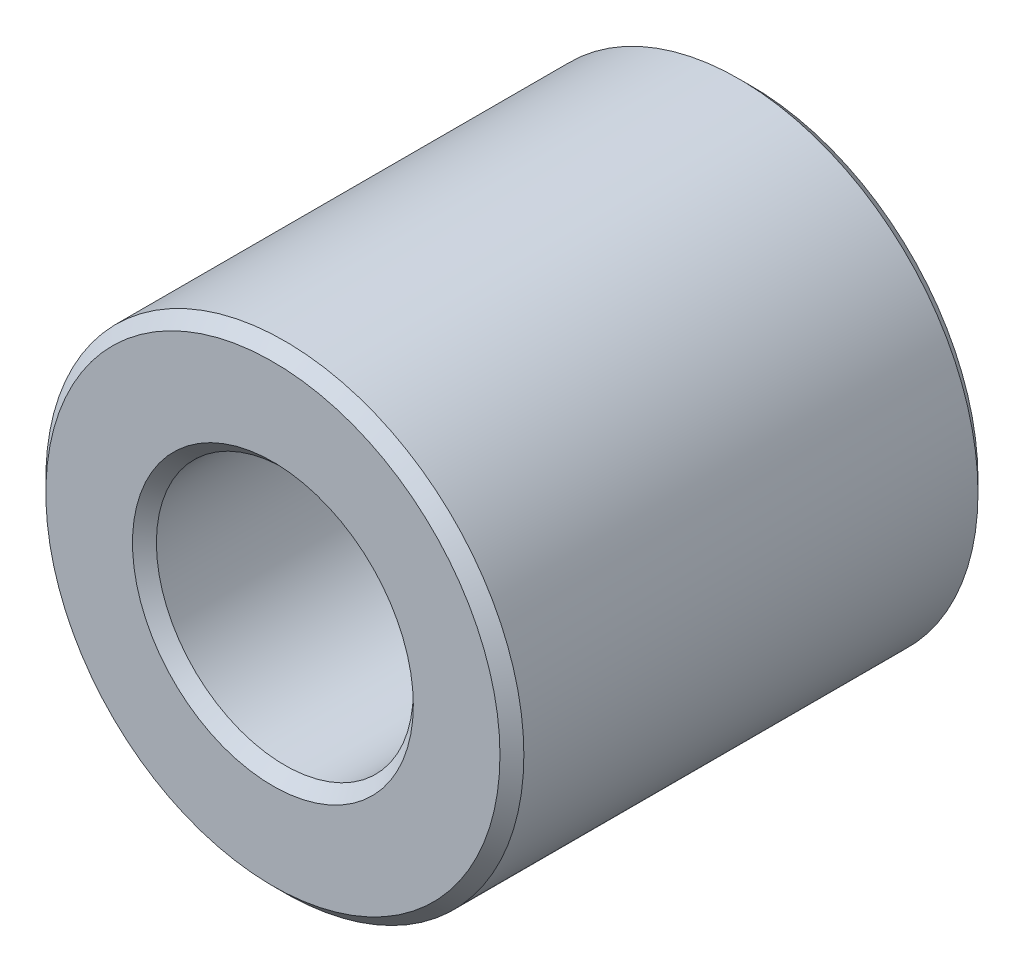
ISO-10303-21;
HEADER;
FILE_DESCRIPTION(('STEP AP214'),'2;1');
FILE_NAME('part.step','',(''),(''),'','','');
FILE_SCHEMA(('AUTOMOTIVE_DESIGN { 1 0 10303 214 1 1 1 1 }'));
ENDSEC;
DATA;
#1=APPLICATION_CONTEXT('core data for automotive mechanical design processes');
#2=APPLICATION_PROTOCOL_DEFINITION('international standard','automotive_design',2000,#1);
#3=PRODUCT_CONTEXT('',#1,'mechanical');
#4=PRODUCT('Part','Part','',(#3));
#5=PRODUCT_RELATED_PRODUCT_CATEGORY('part','',(#4));
#6=PRODUCT_DEFINITION_FORMATION('','',#4);
#7=PRODUCT_DEFINITION_CONTEXT('part definition',#1,'design');
#8=PRODUCT_DEFINITION('design','',#6,#7);
#9=PRODUCT_DEFINITION_SHAPE('','',#8);
#10=(LENGTH_UNIT() NAMED_UNIT(*) SI_UNIT(.MILLI.,.METRE.));
#11=(NAMED_UNIT(*) PLANE_ANGLE_UNIT() SI_UNIT($,.RADIAN.));
#12=(NAMED_UNIT(*) SI_UNIT($,.STERADIAN.) SOLID_ANGLE_UNIT());
#13=UNCERTAINTY_MEASURE_WITH_UNIT(LENGTH_MEASURE(1.E-05),#10,'distance_accuracy_value','');
#14=(GEOMETRIC_REPRESENTATION_CONTEXT(3) GLOBAL_UNCERTAINTY_ASSIGNED_CONTEXT((#13)) GLOBAL_UNIT_ASSIGNED_CONTEXT((#10,
#11,#12)) REPRESENTATION_CONTEXT('',''));
#15=CARTESIAN_POINT('',(0.,0.,0.));
#16=DIRECTION('',(0.,0.,1.));
#17=DIRECTION('',(1.,0.,0.));
#18=AXIS2_PLACEMENT_3D('',#15,#16,#17);
#19=CARTESIAN_POINT('',(0.,0.,4.));
#20=DIRECTION('',(0.,0.,1.));
#21=DIRECTION('',(1.,0.,0.));
#22=AXIS2_PLACEMENT_3D('',#19,#20,#21);
#23=PLANE('',#22);
#24=CARTESIAN_POINT('',(0.,0.,4.));
#25=DIRECTION('',(0.,0.,1.));
#26=DIRECTION('',(1.,0.,0.));
#27=AXIS2_PLACEMENT_3D('',#24,#25,#26);
#28=CIRCLE('',#27,2.35);
#29=CARTESIAN_POINT('',(2.35,0.,4.));
#30=VERTEX_POINT('',#29);
#31=EDGE_CURVE('E10',#30,#30,#28,.F.);
#32=ORIENTED_EDGE('',*,*,#31,.T.);
#33=EDGE_LOOP('',(#32));
#34=FACE_BOUND('',#33,.T.);
#35=CARTESIAN_POINT('',(0.,0.,4.));
#36=DIRECTION('',(0.,0.,1.));
#37=DIRECTION('',(1.,0.,0.));
#38=AXIS2_PLACEMENT_3D('',#35,#36,#37);
#39=CIRCLE('',#38,3.8);
#40=CARTESIAN_POINT('',(3.8,0.,4.));
#41=VERTEX_POINT('',#40);
#42=EDGE_CURVE('E45',#41,#41,#39,.T.);
#43=ORIENTED_EDGE('',*,*,#42,.T.);
#44=EDGE_LOOP('',(#43));
#45=FACE_BOUND('',#44,.T.);
#46=ADVANCED_FACE('F37',(#34,#45),#23,.T.);
#47=CARTESIAN_POINT('',(0.,0.,-4.));
#48=DIRECTION('',(0.,0.,1.));
#49=DIRECTION('',(1.,0.,0.));
#50=AXIS2_PLACEMENT_3D('',#47,#48,#49);
#51=PLANE('',#50);
#52=CARTESIAN_POINT('',(0.,0.,-4.));
#53=DIRECTION('',(0.,0.,1.));
#54=DIRECTION('',(1.,0.,0.));
#55=AXIS2_PLACEMENT_3D('',#52,#53,#54);
#56=CIRCLE('',#55,3.8);
#57=CARTESIAN_POINT('',(3.8,0.,-4.));
#58=VERTEX_POINT('',#57);
#59=EDGE_CURVE('E62',#58,#58,#56,.F.);
#60=ORIENTED_EDGE('',*,*,#59,.T.);
#61=EDGE_LOOP('',(#60));
#62=FACE_BOUND('',#61,.T.);
#63=CARTESIAN_POINT('',(0.,0.,-4.));
#64=DIRECTION('',(0.,0.,1.));
#65=DIRECTION('',(1.,0.,0.));
#66=AXIS2_PLACEMENT_3D('',#63,#64,#65);
#67=CIRCLE('',#66,2.35);
#68=CARTESIAN_POINT('',(2.35,0.,-4.));
#69=VERTEX_POINT('',#68);
#70=EDGE_CURVE('E66',#69,#69,#67,.T.);
#71=ORIENTED_EDGE('',*,*,#70,.T.);
#72=EDGE_LOOP('',(#71));
#73=FACE_BOUND('',#72,.T.);
#74=ADVANCED_FACE('F89',(#62,#73),#51,.F.);
#75=CARTESIAN_POINT('',(0.,0.,4.));
#76=DIRECTION('',(0.,0.,-1.));
#77=DIRECTION('',(-1.,0.,0.));
#78=AXIS2_PLACEMENT_3D('',#75,#76,#77);
#79=CYLINDRICAL_SURFACE('',#78,4.);
#80=CARTESIAN_POINT('',(0.,0.,-3.8));
#81=DIRECTION('',(0.,0.,1.));
#82=DIRECTION('',(1.,0.,0.));
#83=AXIS2_PLACEMENT_3D('',#80,#81,#82);
#84=CIRCLE('',#83,4.);
#85=CARTESIAN_POINT('',(4.,0.,-3.8));
#86=VERTEX_POINT('',#85);
#87=EDGE_CURVE('E70',#86,#86,#84,.T.);
#88=ORIENTED_EDGE('',*,*,#87,.T.);
#89=EDGE_LOOP('',(#88));
#90=FACE_BOUND('',#89,.T.);
#91=CARTESIAN_POINT('',(0.,0.,3.8));
#92=DIRECTION('',(0.,0.,1.));
#93=DIRECTION('',(1.,0.,0.));
#94=AXIS2_PLACEMENT_3D('',#91,#92,#93);
#95=CIRCLE('',#94,4.);
#96=CARTESIAN_POINT('',(4.,0.,3.8));
#97=VERTEX_POINT('',#96);
#98=EDGE_CURVE('E74',#97,#97,#95,.F.);
#99=ORIENTED_EDGE('',*,*,#98,.T.);
#100=EDGE_LOOP('',(#99));
#101=FACE_BOUND('',#100,.T.);
#102=ADVANCED_FACE('F78',(#90,#101),#79,.T.);
#103=CARTESIAN_POINT('',(0.,0.,4.));
#104=DIRECTION('',(0.,0.,-1.));
#105=DIRECTION('',(-1.,0.,0.));
#106=AXIS2_PLACEMENT_3D('',#103,#104,#105);
#107=CYLINDRICAL_SURFACE('',#106,2.15);
#108=CARTESIAN_POINT('',(0.,0.,-3.8));
#109=DIRECTION('',(0.,0.,1.));
#110=DIRECTION('',(1.,0.,0.));
#111=AXIS2_PLACEMENT_3D('',#108,#109,#110);
#112=CIRCLE('',#111,2.15);
#113=CARTESIAN_POINT('',(2.15,0.,-3.8));
#114=VERTEX_POINT('',#113);
#115=EDGE_CURVE('E51',#114,#114,#112,.F.);
#116=ORIENTED_EDGE('',*,*,#115,.T.);
#117=EDGE_LOOP('',(#116));
#118=FACE_BOUND('',#117,.T.);
#119=CARTESIAN_POINT('',(0.,0.,3.8));
#120=DIRECTION('',(0.,0.,1.));
#121=DIRECTION('',(1.,0.,0.));
#122=AXIS2_PLACEMENT_3D('',#119,#120,#121);
#123=CIRCLE('',#122,2.15);
#124=CARTESIAN_POINT('',(2.15,0.,3.8));
#125=VERTEX_POINT('',#124);
#126=EDGE_CURVE('E56',#125,#125,#123,.T.);
#127=ORIENTED_EDGE('',*,*,#126,.T.);
#128=EDGE_LOOP('',(#127));
#129=FACE_BOUND('',#128,.T.);
#130=ADVANCED_FACE('F97',(#118,#129),#107,.F.);
#131=CARTESIAN_POINT('',(0.,0.,-3.8));
#132=DIRECTION('',(0.,0.,1.));
#133=DIRECTION('',(1.,0.,0.));
#134=AXIS2_PLACEMENT_3D('',#131,#132,#133);
#135=CONICAL_SURFACE('',#134,4.,0.785398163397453);
#136=CARTESIAN_POINT('',(3.8,0.,-4.));
#137=CARTESIAN_POINT('',(3.80208333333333,0.,-3.99791666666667));
#138=CARTESIAN_POINT('',(3.80416666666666,0.,-3.99583333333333));
#139=CARTESIAN_POINT('',(3.80833333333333,0.,-3.99166666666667));
#140=CARTESIAN_POINT('',(3.81041666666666,0.,-3.98958333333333));
#141=CARTESIAN_POINT('',(3.81458333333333,0.,-3.98541666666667));
#142=CARTESIAN_POINT('',(3.81666666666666,0.,-3.98333333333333));
#143=CARTESIAN_POINT('',(3.82083333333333,0.,-3.97916666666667));
#144=CARTESIAN_POINT('',(3.82291666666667,0.,-3.97708333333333));
#145=CARTESIAN_POINT('',(3.82708333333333,0.,-3.97291666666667));
#146=CARTESIAN_POINT('',(3.82916666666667,0.,-3.97083333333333));
#147=CARTESIAN_POINT('',(3.83333333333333,0.,-3.96666666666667));
#148=CARTESIAN_POINT('',(3.83541666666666,0.,-3.96458333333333));
#149=CARTESIAN_POINT('',(3.83958333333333,0.,-3.96041666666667));
#150=CARTESIAN_POINT('',(3.84166666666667,0.,-3.95833333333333));
#151=CARTESIAN_POINT('',(3.84583333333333,0.,-3.95416666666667));
#152=CARTESIAN_POINT('',(3.84791666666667,0.,-3.95208333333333));
#153=CARTESIAN_POINT('',(3.85208333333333,0.,-3.94791666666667));
#154=CARTESIAN_POINT('',(3.85416666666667,0.,-3.94583333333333));
#155=CARTESIAN_POINT('',(3.85833333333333,0.,-3.94166666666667));
#156=CARTESIAN_POINT('',(3.86041666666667,0.,-3.93958333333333));
#157=CARTESIAN_POINT('',(3.86458333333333,0.,-3.93541666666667));
#158=CARTESIAN_POINT('',(3.86666666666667,0.,-3.93333333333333));
#159=CARTESIAN_POINT('',(3.87083333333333,0.,-3.92916666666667));
#160=CARTESIAN_POINT('',(3.87291666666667,0.,-3.92708333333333));
#161=CARTESIAN_POINT('',(3.87708333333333,0.,-3.92291666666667));
#162=CARTESIAN_POINT('',(3.87916666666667,0.,-3.92083333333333));
#163=CARTESIAN_POINT('',(3.88333333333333,0.,-3.91666666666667));
#164=CARTESIAN_POINT('',(3.88541666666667,0.,-3.91458333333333));
#165=CARTESIAN_POINT('',(3.88958333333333,0.,-3.91041666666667));
#166=CARTESIAN_POINT('',(3.89166666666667,0.,-3.90833333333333));
#167=CARTESIAN_POINT('',(3.89583333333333,0.,-3.90416666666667));
#168=CARTESIAN_POINT('',(3.89791666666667,0.,-3.90208333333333));
#169=CARTESIAN_POINT('',(3.90208333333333,0.,-3.89791666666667));
#170=CARTESIAN_POINT('',(3.90416666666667,0.,-3.89583333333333));
#171=CARTESIAN_POINT('',(3.90833333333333,0.,-3.89166666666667));
#172=CARTESIAN_POINT('',(3.91041666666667,0.,-3.88958333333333));
#173=CARTESIAN_POINT('',(3.91458333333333,0.,-3.88541666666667));
#174=CARTESIAN_POINT('',(3.91666666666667,0.,-3.88333333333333));
#175=CARTESIAN_POINT('',(3.92083333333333,0.,-3.87916666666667));
#176=CARTESIAN_POINT('',(3.92291666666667,0.,-3.87708333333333));
#177=CARTESIAN_POINT('',(3.92708333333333,0.,-3.87291666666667));
#178=CARTESIAN_POINT('',(3.92916666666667,0.,-3.87083333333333));
#179=CARTESIAN_POINT('',(3.93333333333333,0.,-3.86666666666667));
#180=CARTESIAN_POINT('',(3.93541666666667,0.,-3.86458333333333));
#181=CARTESIAN_POINT('',(3.93958333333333,0.,-3.86041666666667));
#182=CARTESIAN_POINT('',(3.94166666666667,0.,-3.85833333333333));
#183=CARTESIAN_POINT('',(3.94583333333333,0.,-3.85416666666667));
#184=CARTESIAN_POINT('',(3.94791666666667,0.,-3.85208333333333));
#185=CARTESIAN_POINT('',(3.95208333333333,0.,-3.84791666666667));
#186=CARTESIAN_POINT('',(3.95416666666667,0.,-3.84583333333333));
#187=CARTESIAN_POINT('',(3.95833333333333,0.,-3.84166666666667));
#188=CARTESIAN_POINT('',(3.96041666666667,0.,-3.83958333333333));
#189=CARTESIAN_POINT('',(3.96458333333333,0.,-3.83541666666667));
#190=CARTESIAN_POINT('',(3.96666666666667,0.,-3.83333333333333));
#191=CARTESIAN_POINT('',(3.97083333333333,0.,-3.82916666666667));
#192=CARTESIAN_POINT('',(3.97291666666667,0.,-3.82708333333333));
#193=CARTESIAN_POINT('',(3.97708333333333,0.,-3.82291666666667));
#194=CARTESIAN_POINT('',(3.97916666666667,0.,-3.82083333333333));
#195=CARTESIAN_POINT('',(3.98333333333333,0.,-3.81666666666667));
#196=CARTESIAN_POINT('',(3.98541666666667,0.,-3.81458333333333));
#197=CARTESIAN_POINT('',(3.98958333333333,0.,-3.81041666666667));
#198=CARTESIAN_POINT('',(3.99166666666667,0.,-3.80833333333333));
#199=CARTESIAN_POINT('',(3.99583333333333,0.,-3.80416666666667));
#200=CARTESIAN_POINT('',(3.99791666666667,0.,-3.80208333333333));
#201=CARTESIAN_POINT('',(4.,0.,-3.8));
#202=B_SPLINE_CURVE_WITH_KNOTS('',3,(#136,#137,#138,#139,#140,#141,#142,#143,#144,#145,#146,
#147,#148,#149,#150,#151,#152,#153,#154,#155,#156,#157,#158,#159,#160,#161,#162,#163,#164,#165,
#166,#167,#168,#169,#170,#171,#172,#173,#174,#175,#176,#177,#178,#179,#180,#181,#182,#183,#184,
#185,#186,#187,#188,#189,#190,#191,#192,#193,#194,#195,#196,#197,#198,#199,#200,#201),
.UNSPECIFIED.,.F.,.F.,(4,2,2,2,2,2,2,2,2,2,2,2,2,2,2,2,2,2,2,2,2,2,2,2,2,2,2,2,2,2,2,2,4),(0.,
0.00883883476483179,0.0176776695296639,0.026516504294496,0.0353553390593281,0.0441941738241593,
0.0530330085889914,0.0618718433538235,0.0707106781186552,0.0795495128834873,0.0883883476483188,
0.0972271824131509,0.106066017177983,0.114904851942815,0.123743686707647,0.132582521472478,
0.14142135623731,0.150260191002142,0.159099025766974,0.167937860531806,0.176776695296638,
0.185615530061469,0.194454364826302,0.203293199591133,0.212132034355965,0.220970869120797,
0.229809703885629,0.238648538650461,0.247487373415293,0.256326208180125,0.265165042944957,
0.274003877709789,0.282842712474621),.UNSPECIFIED.);
#203=EDGE_CURVE('BSEAM102',#58,#86,#202,.T.);
#204=ORIENTED_EDGE('',*,*,#59,.F.);
#205=ORIENTED_EDGE('',*,*,#87,.F.);
#206=ORIENTED_EDGE('',*,*,#203,.T.);
#207=ORIENTED_EDGE('',*,*,#203,.F.);
#208=EDGE_LOOP('',(#204,#206,#205,#207));
#209=FACE_BOUND('',#208,.T.);
#210=ADVANCED_FACE('F102',(#209),#135,.T.);
#211=CARTESIAN_POINT('',(0.,0.,-4.));
#212=DIRECTION('',(0.,0.,-1.));
#213=DIRECTION('',(-1.,0.,0.));
#214=AXIS2_PLACEMENT_3D('',#211,#212,#213);
#215=CONICAL_SURFACE('',#214,2.35,0.785398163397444);
#216=ORIENTED_EDGE('',*,*,#115,.F.);
#217=EDGE_LOOP('',(#216));
#218=FACE_BOUND('',#217,.T.);
#219=ORIENTED_EDGE('',*,*,#70,.F.);
#220=EDGE_LOOP('',(#219));
#221=FACE_BOUND('',#220,.T.);
#222=ADVANCED_FACE('F86',(#218,#221),#215,.F.);
#223=CARTESIAN_POINT('',(0.,0.,3.8));
#224=DIRECTION('',(0.,0.,1.));
#225=DIRECTION('',(1.,0.,0.));
#226=AXIS2_PLACEMENT_3D('',#223,#224,#225);
#227=CONICAL_SURFACE('',#226,2.15,0.785398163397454);
#228=CARTESIAN_POINT('',(2.35,0.,4.));
#229=CARTESIAN_POINT('',(2.34791666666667,0.,3.99791666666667));
#230=CARTESIAN_POINT('',(2.34583333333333,0.,3.99583333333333));
#231=CARTESIAN_POINT('',(2.34166666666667,0.,3.99166666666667));
#232=CARTESIAN_POINT('',(2.33958333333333,0.,3.98958333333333));
#233=CARTESIAN_POINT('',(2.33541666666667,0.,3.98541666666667));
#234=CARTESIAN_POINT('',(2.33333333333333,0.,3.98333333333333));
#235=CARTESIAN_POINT('',(2.32916666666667,0.,3.97916666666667));
#236=CARTESIAN_POINT('',(2.32708333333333,0.,3.97708333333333));
#237=CARTESIAN_POINT('',(2.32291666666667,0.,3.97291666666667));
#238=CARTESIAN_POINT('',(2.32083333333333,0.,3.97083333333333));
#239=CARTESIAN_POINT('',(2.31666666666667,0.,3.96666666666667));
#240=CARTESIAN_POINT('',(2.31458333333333,0.,3.96458333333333));
#241=CARTESIAN_POINT('',(2.31041666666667,0.,3.96041666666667));
#242=CARTESIAN_POINT('',(2.30833333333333,0.,3.95833333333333));
#243=CARTESIAN_POINT('',(2.30416666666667,0.,3.95416666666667));
#244=CARTESIAN_POINT('',(2.30208333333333,0.,3.95208333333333));
#245=CARTESIAN_POINT('',(2.29791666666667,0.,3.94791666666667));
#246=CARTESIAN_POINT('',(2.29583333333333,0.,3.94583333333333));
#247=CARTESIAN_POINT('',(2.29166666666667,0.,3.94166666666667));
#248=CARTESIAN_POINT('',(2.28958333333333,0.,3.93958333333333));
#249=CARTESIAN_POINT('',(2.28541666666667,0.,3.93541666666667));
#250=CARTESIAN_POINT('',(2.28333333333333,0.,3.93333333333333));
#251=CARTESIAN_POINT('',(2.27916666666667,0.,3.92916666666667));
#252=CARTESIAN_POINT('',(2.27708333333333,0.,3.92708333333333));
#253=CARTESIAN_POINT('',(2.27291666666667,0.,3.92291666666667));
#254=CARTESIAN_POINT('',(2.27083333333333,0.,3.92083333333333));
#255=CARTESIAN_POINT('',(2.26666666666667,0.,3.91666666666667));
#256=CARTESIAN_POINT('',(2.26458333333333,0.,3.91458333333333));
#257=CARTESIAN_POINT('',(2.26041666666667,0.,3.91041666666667));
#258=CARTESIAN_POINT('',(2.25833333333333,0.,3.90833333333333));
#259=CARTESIAN_POINT('',(2.25416666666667,0.,3.90416666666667));
#260=CARTESIAN_POINT('',(2.25208333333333,0.,3.90208333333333));
#261=CARTESIAN_POINT('',(2.24791666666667,0.,3.89791666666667));
#262=CARTESIAN_POINT('',(2.24583333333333,0.,3.89583333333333));
#263=CARTESIAN_POINT('',(2.24166666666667,0.,3.89166666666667));
#264=CARTESIAN_POINT('',(2.23958333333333,0.,3.88958333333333));
#265=CARTESIAN_POINT('',(2.23541666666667,0.,3.88541666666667));
#266=CARTESIAN_POINT('',(2.23333333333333,0.,3.88333333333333));
#267=CARTESIAN_POINT('',(2.22916666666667,0.,3.87916666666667));
#268=CARTESIAN_POINT('',(2.22708333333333,0.,3.87708333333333));
#269=CARTESIAN_POINT('',(2.22291666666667,0.,3.87291666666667));
#270=CARTESIAN_POINT('',(2.22083333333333,0.,3.87083333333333));
#271=CARTESIAN_POINT('',(2.21666666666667,0.,3.86666666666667));
#272=CARTESIAN_POINT('',(2.21458333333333,0.,3.86458333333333));
#273=CARTESIAN_POINT('',(2.21041666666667,0.,3.86041666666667));
#274=CARTESIAN_POINT('',(2.20833333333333,0.,3.85833333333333));
#275=CARTESIAN_POINT('',(2.20416666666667,0.,3.85416666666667));
#276=CARTESIAN_POINT('',(2.20208333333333,0.,3.85208333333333));
#277=CARTESIAN_POINT('',(2.19791666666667,0.,3.84791666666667));
#278=CARTESIAN_POINT('',(2.19583333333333,0.,3.84583333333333));
#279=CARTESIAN_POINT('',(2.19166666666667,0.,3.84166666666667));
#280=CARTESIAN_POINT('',(2.18958333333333,0.,3.83958333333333));
#281=CARTESIAN_POINT('',(2.18541666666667,0.,3.83541666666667));
#282=CARTESIAN_POINT('',(2.18333333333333,0.,3.83333333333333));
#283=CARTESIAN_POINT('',(2.17916666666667,0.,3.82916666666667));
#284=CARTESIAN_POINT('',(2.17708333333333,0.,3.82708333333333));
#285=CARTESIAN_POINT('',(2.17291666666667,0.,3.82291666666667));
#286=CARTESIAN_POINT('',(2.17083333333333,0.,3.82083333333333));
#287=CARTESIAN_POINT('',(2.16666666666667,0.,3.81666666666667));
#288=CARTESIAN_POINT('',(2.16458333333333,0.,3.81458333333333));
#289=CARTESIAN_POINT('',(2.16041666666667,0.,3.81041666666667));
#290=CARTESIAN_POINT('',(2.15833333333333,0.,3.80833333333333));
#291=CARTESIAN_POINT('',(2.15416666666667,0.,3.80416666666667));
#292=CARTESIAN_POINT('',(2.15208333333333,0.,3.80208333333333));
#293=CARTESIAN_POINT('',(2.15,0.,3.8));
#294=B_SPLINE_CURVE_WITH_KNOTS('',3,(#228,#229,#230,#231,#232,#233,#234,#235,#236,#237,#238,
#239,#240,#241,#242,#243,#244,#245,#246,#247,#248,#249,#250,#251,#252,#253,#254,#255,#256,#257,
#258,#259,#260,#261,#262,#263,#264,#265,#266,#267,#268,#269,#270,#271,#272,#273,#274,#275,#276,
#277,#278,#279,#280,#281,#282,#283,#284,#285,#286,#287,#288,#289,#290,#291,#292,#293),
.UNSPECIFIED.,.F.,.F.,(4,2,2,2,2,2,2,2,2,2,2,2,2,2,2,2,2,2,2,2,2,2,2,2,2,2,2,2,2,2,2,2,4),(0.,
0.00883883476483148,0.0176776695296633,0.0265165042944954,0.0353553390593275,0.0441941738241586,
0.0530330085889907,0.0618718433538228,0.0707106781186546,0.0795495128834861,0.0883883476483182,
0.09722718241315,0.106066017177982,0.114904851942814,0.123743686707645,0.132582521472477,
0.141421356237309,0.150260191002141,0.159099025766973,0.167937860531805,0.176776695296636,
0.185615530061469,0.1944543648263,0.203293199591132,0.212132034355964,0.220970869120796,
0.229809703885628,0.23864853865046,0.247487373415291,0.256326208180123,0.265165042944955,
0.274003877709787,0.282842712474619),.UNSPECIFIED.);
#295=EDGE_CURVE('BSEAM82',#30,#125,#294,.T.);
#296=ORIENTED_EDGE('',*,*,#31,.F.);
#297=ORIENTED_EDGE('',*,*,#126,.F.);
#298=ORIENTED_EDGE('',*,*,#295,.T.);
#299=ORIENTED_EDGE('',*,*,#295,.F.);
#300=EDGE_LOOP('',(#296,#298,#297,#299));
#301=FACE_BOUND('',#300,.T.);
#302=ADVANCED_FACE('F82',(#301),#227,.F.);
#303=CARTESIAN_POINT('',(0.,0.,4.));
#304=DIRECTION('',(0.,0.,-1.));
#305=DIRECTION('',(-1.,0.,0.));
#306=AXIS2_PLACEMENT_3D('',#303,#304,#305);
#307=CONICAL_SURFACE('',#306,3.8,0.785398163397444);
#308=ORIENTED_EDGE('',*,*,#98,.F.);
#309=EDGE_LOOP('',(#308));
#310=FACE_BOUND('',#309,.T.);
#311=ORIENTED_EDGE('',*,*,#42,.F.);
#312=EDGE_LOOP('',(#311));
#313=FACE_BOUND('',#312,.T.);
#314=ADVANCED_FACE('F39',(#310,#313),#307,.T.);
#315=CLOSED_SHELL('',(#46,#74,#102,#130,#210,#222,#302,#314));
#316=MANIFOLD_SOLID_BREP('B2',#315);
#317=ADVANCED_BREP_SHAPE_REPRESENTATION('',(#18,#316),#14);
#318=SHAPE_DEFINITION_REPRESENTATION(#9,#317);
ENDSEC;
END-ISO-10303-21;
